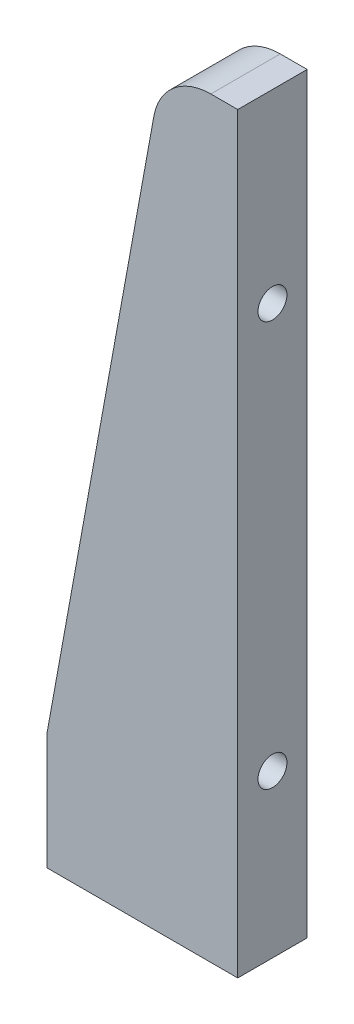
ISO-10303-21;
HEADER;
FILE_DESCRIPTION(('STEP AP214'),'2;1');
FILE_NAME('part.step','',(''),(''),'','','');
FILE_SCHEMA(('AUTOMOTIVE_DESIGN { 1 0 10303 214 1 1 1 1 }'));
ENDSEC;
DATA;
#1=APPLICATION_CONTEXT('core data for automotive mechanical design processes');
#2=APPLICATION_PROTOCOL_DEFINITION('international standard','automotive_design',2000,#1);
#3=PRODUCT_CONTEXT('',#1,'mechanical');
#4=PRODUCT('Part','Part','',(#3));
#5=PRODUCT_RELATED_PRODUCT_CATEGORY('part','',(#4));
#6=PRODUCT_DEFINITION_FORMATION('','',#4);
#7=PRODUCT_DEFINITION_CONTEXT('part definition',#1,'design');
#8=PRODUCT_DEFINITION('design','',#6,#7);
#9=PRODUCT_DEFINITION_SHAPE('','',#8);
#10=(LENGTH_UNIT() NAMED_UNIT(*) SI_UNIT(.MILLI.,.METRE.));
#11=(NAMED_UNIT(*) PLANE_ANGLE_UNIT() SI_UNIT($,.RADIAN.));
#12=(NAMED_UNIT(*) SI_UNIT($,.STERADIAN.) SOLID_ANGLE_UNIT());
#13=UNCERTAINTY_MEASURE_WITH_UNIT(LENGTH_MEASURE(1.E-05),#10,'distance_accuracy_value','');
#14=(GEOMETRIC_REPRESENTATION_CONTEXT(3) GLOBAL_UNCERTAINTY_ASSIGNED_CONTEXT((#13)) GLOBAL_UNIT_ASSIGNED_CONTEXT((#10,
#11,#12)) REPRESENTATION_CONTEXT('',''));
#15=CARTESIAN_POINT('',(0.,0.,0.));
#16=DIRECTION('',(0.,0.,1.));
#17=DIRECTION('',(1.,0.,0.));
#18=AXIS2_PLACEMENT_3D('',#15,#16,#17);
#19=CARTESIAN_POINT('',(-56.,0.,12.));
#20=DIRECTION('',(-1.,0.,0.));
#21=DIRECTION('',(0.,0.,1.));
#22=AXIS2_PLACEMENT_3D('',#19,#20,#21);
#23=PLANE('',#22);
#24=CARTESIAN_POINT('',(-56.,28.,6.));
#25=DIRECTION('',(1.,0.,0.));
#26=DIRECTION('',(0.,0.,-1.));
#27=AXIS2_PLACEMENT_3D('',#24,#25,#26);
#28=CIRCLE('',#27,2.5);
#29=CARTESIAN_POINT('',(-56.,28.,3.5));
#30=VERTEX_POINT('',#29);
#31=EDGE_CURVE('E88',#30,#30,#28,.T.);
#32=ORIENTED_EDGE('',*,*,#31,.F.);
#33=EDGE_LOOP('',(#32));
#34=FACE_BOUND('',#33,.T.);
#35=DIRECTION('',(0.,1.,0.));
#36=VECTOR('',#35,1.);
#37=CARTESIAN_POINT('',(-56.,0.,0.));
#38=LINE('',#37,#36);
#39=CARTESIAN_POINT('',(-56.,0.,0.));
#40=VERTEX_POINT('',#39);
#41=CARTESIAN_POINT('',(-56.,130.,0.));
#42=VERTEX_POINT('',#41);
#43=EDGE_CURVE('E110',#40,#42,#38,.T.);
#44=ORIENTED_EDGE('',*,*,#43,.T.);
#45=DIRECTION('',(0.,0.,-1.));
#46=VECTOR('',#45,1.);
#47=CARTESIAN_POINT('',(-56.,130.,12.));
#48=LINE('',#47,#46);
#49=CARTESIAN_POINT('',(-56.,130.,12.));
#50=VERTEX_POINT('',#49);
#51=EDGE_CURVE('E141',#50,#42,#48,.T.);
#52=ORIENTED_EDGE('',*,*,#51,.F.);
#53=DIRECTION('',(0.,1.,0.));
#54=VECTOR('',#53,1.);
#55=CARTESIAN_POINT('',(-56.,0.,12.));
#56=LINE('',#55,#54);
#57=CARTESIAN_POINT('',(-56.,0.,12.));
#58=VERTEX_POINT('',#57);
#59=EDGE_CURVE('E111',#58,#50,#56,.T.);
#60=ORIENTED_EDGE('',*,*,#59,.F.);
#61=DIRECTION('',(0.,0.,-1.));
#62=VECTOR('',#61,1.);
#63=CARTESIAN_POINT('',(-56.,0.,12.));
#64=LINE('',#63,#62);
#65=EDGE_CURVE('E123',#58,#40,#64,.T.);
#66=ORIENTED_EDGE('',*,*,#65,.T.);
#67=EDGE_LOOP('',(#44,#52,#60,#66));
#68=FACE_BOUND('',#67,.T.);
#69=CARTESIAN_POINT('',(-56.,98.,6.));
#70=DIRECTION('',(1.,0.,0.));
#71=DIRECTION('',(0.,0.,-1.));
#72=AXIS2_PLACEMENT_3D('',#69,#70,#71);
#73=CIRCLE('',#72,2.5);
#74=CARTESIAN_POINT('',(-56.,98.,3.5));
#75=VERTEX_POINT('',#74);
#76=EDGE_CURVE('E87',#75,#75,#73,.T.);
#77=ORIENTED_EDGE('',*,*,#76,.F.);
#78=EDGE_LOOP('',(#77));
#79=FACE_BOUND('',#78,.T.);
#80=ADVANCED_FACE('F16',(#34,#68,#79),#23,.F.);
#81=CARTESIAN_POINT('',(-56.,130.,12.));
#82=DIRECTION('',(0.,-1.,0.));
#83=DIRECTION('',(0.,0.,-1.));
#84=AXIS2_PLACEMENT_3D('',#81,#82,#83);
#85=PLANE('',#84);
#86=DIRECTION('',(-1.,0.,0.));
#87=VECTOR('',#86,1.);
#88=CARTESIAN_POINT('',(-56.,130.,0.));
#89=LINE('',#88,#87);
#90=CARTESIAN_POINT('',(-60.6542364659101,130.,0.));
#91=VERTEX_POINT('',#90);
#92=EDGE_CURVE('E126',#42,#91,#89,.T.);
#93=ORIENTED_EDGE('',*,*,#92,.T.);
#94=DIRECTION('',(0.,0.,-1.));
#95=VECTOR('',#94,1.);
#96=CARTESIAN_POINT('',(-60.6542364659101,130.,12.));
#97=LINE('',#96,#95);
#98=CARTESIAN_POINT('',(-60.6542364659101,130.,12.));
#99=VERTEX_POINT('',#98);
#100=EDGE_CURVE('E24',#91,#99,#97,.F.);
#101=ORIENTED_EDGE('',*,*,#100,.T.);
#102=DIRECTION('',(-1.,0.,0.));
#103=VECTOR('',#102,1.);
#104=CARTESIAN_POINT('',(-56.,130.,12.));
#105=LINE('',#104,#103);
#106=EDGE_CURVE('E114',#50,#99,#105,.T.);
#107=ORIENTED_EDGE('',*,*,#106,.F.);
#108=ORIENTED_EDGE('',*,*,#51,.T.);
#109=EDGE_LOOP('',(#93,#101,#107,#108));
#110=FACE_BOUND('',#109,.T.);
#111=ADVANCED_FACE('F178',(#110),#85,.F.);
#112=CARTESIAN_POINT('',(-69.,130.,12.));
#113=DIRECTION('',(0.983869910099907,-0.178885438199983,0.));
#114=DIRECTION('',(0.178885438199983,0.983869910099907,0.));
#115=AXIS2_PLACEMENT_3D('',#112,#113,#114);
#116=PLANE('',#115);
#117=DIRECTION('',(-0.178885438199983,-0.983869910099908,0.));
#118=VECTOR('',#117,1.);
#119=CARTESIAN_POINT('',(-69.,130.,12.));
#120=LINE('',#119,#118);
#121=CARTESIAN_POINT('',(-70.4929355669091,121.788854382,12.));
#122=VERTEX_POINT('',#121);
#123=CARTESIAN_POINT('',(-89.,20.,12.));
#124=VERTEX_POINT('',#123);
#125=EDGE_CURVE('E117',#122,#124,#120,.T.);
#126=ORIENTED_EDGE('',*,*,#125,.F.);
#127=DIRECTION('',(0.,0.,-1.));
#128=VECTOR('',#127,1.);
#129=CARTESIAN_POINT('',(-70.4929355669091,121.788854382,12.));
#130=LINE('',#129,#128);
#131=CARTESIAN_POINT('',(-70.4929355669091,121.788854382,0.));
#132=VERTEX_POINT('',#131);
#133=EDGE_CURVE('E144',#122,#132,#130,.T.);
#134=ORIENTED_EDGE('',*,*,#133,.T.);
#135=DIRECTION('',(-0.178885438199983,-0.983869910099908,0.));
#136=VECTOR('',#135,1.);
#137=CARTESIAN_POINT('',(-69.,130.,0.));
#138=LINE('',#137,#136);
#139=CARTESIAN_POINT('',(-89.,20.,0.));
#140=VERTEX_POINT('',#139);
#141=EDGE_CURVE('E128',#132,#140,#138,.T.);
#142=ORIENTED_EDGE('',*,*,#141,.T.);
#143=DIRECTION('',(0.,0.,-1.));
#144=VECTOR('',#143,1.);
#145=CARTESIAN_POINT('',(-89.,20.,12.));
#146=LINE('',#145,#144);
#147=EDGE_CURVE('E138',#124,#140,#146,.T.);
#148=ORIENTED_EDGE('',*,*,#147,.F.);
#149=EDGE_LOOP('',(#126,#134,#142,#148));
#150=FACE_BOUND('',#149,.T.);
#151=ADVANCED_FACE('F150',(#150),#116,.F.);
#152=CARTESIAN_POINT('',(-89.,0.,12.));
#153=DIRECTION('',(1.,0.,0.));
#154=DIRECTION('',(0.,0.,-1.));
#155=AXIS2_PLACEMENT_3D('',#152,#153,#154);
#156=PLANE('',#155);
#157=DIRECTION('',(0.,-1.,0.));
#158=VECTOR('',#157,1.);
#159=CARTESIAN_POINT('',(-89.,0.,0.));
#160=LINE('',#159,#158);
#161=CARTESIAN_POINT('',(-89.,0.,0.));
#162=VERTEX_POINT('',#161);
#163=EDGE_CURVE('E130',#140,#162,#160,.T.);
#164=ORIENTED_EDGE('',*,*,#163,.T.);
#165=DIRECTION('',(0.,0.,-1.));
#166=VECTOR('',#165,1.);
#167=CARTESIAN_POINT('',(-89.,0.,12.));
#168=LINE('',#167,#166);
#169=CARTESIAN_POINT('',(-89.,0.,12.));
#170=VERTEX_POINT('',#169);
#171=EDGE_CURVE('E135',#170,#162,#168,.T.);
#172=ORIENTED_EDGE('',*,*,#171,.F.);
#173=DIRECTION('',(0.,-1.,0.));
#174=VECTOR('',#173,1.);
#175=CARTESIAN_POINT('',(-89.,0.,12.));
#176=LINE('',#175,#174);
#177=EDGE_CURVE('E119',#124,#170,#176,.T.);
#178=ORIENTED_EDGE('',*,*,#177,.F.);
#179=ORIENTED_EDGE('',*,*,#147,.T.);
#180=EDGE_LOOP('',(#164,#172,#178,#179));
#181=FACE_BOUND('',#180,.T.);
#182=ADVANCED_FACE('F160',(#181),#156,.F.);
#183=CARTESIAN_POINT('',(-56.,0.,12.));
#184=DIRECTION('',(0.,1.,0.));
#185=DIRECTION('',(-1.,0.,0.));
#186=AXIS2_PLACEMENT_3D('',#183,#184,#185);
#187=PLANE('',#186);
#188=CARTESIAN_POINT('',(-80.9093619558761,0.,6.));
#189=DIRECTION('',(0.,-1.,0.));
#190=DIRECTION('',(0.,0.,-1.));
#191=AXIS2_PLACEMENT_3D('',#188,#189,#190);
#192=CIRCLE('',#191,2.5);
#193=CARTESIAN_POINT('',(-80.9093619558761,0.,3.5));
#194=VERTEX_POINT('',#193);
#195=EDGE_CURVE('E98',#194,#194,#192,.T.);
#196=ORIENTED_EDGE('',*,*,#195,.F.);
#197=EDGE_LOOP('',(#196));
#198=FACE_BOUND('',#197,.T.);
#199=CARTESIAN_POINT('',(-65.9093619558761,0.,6.));
#200=DIRECTION('',(0.,-1.,0.));
#201=DIRECTION('',(0.,0.,-1.));
#202=AXIS2_PLACEMENT_3D('',#199,#200,#201);
#203=CIRCLE('',#202,2.5);
#204=CARTESIAN_POINT('',(-65.9093619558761,0.,3.5));
#205=VERTEX_POINT('',#204);
#206=EDGE_CURVE('E104',#205,#205,#203,.T.);
#207=ORIENTED_EDGE('',*,*,#206,.F.);
#208=EDGE_LOOP('',(#207));
#209=FACE_BOUND('',#208,.T.);
#210=DIRECTION('',(1.,0.,0.));
#211=VECTOR('',#210,1.);
#212=CARTESIAN_POINT('',(-56.,0.,0.));
#213=LINE('',#212,#211);
#214=EDGE_CURVE('E115',#162,#40,#213,.T.);
#215=ORIENTED_EDGE('',*,*,#214,.T.);
#216=ORIENTED_EDGE('',*,*,#65,.F.);
#217=DIRECTION('',(1.,0.,0.));
#218=VECTOR('',#217,1.);
#219=CARTESIAN_POINT('',(-56.,0.,12.));
#220=LINE('',#219,#218);
#221=EDGE_CURVE('E121',#170,#58,#220,.T.);
#222=ORIENTED_EDGE('',*,*,#221,.F.);
#223=ORIENTED_EDGE('',*,*,#171,.T.);
#224=EDGE_LOOP('',(#215,#216,#222,#223));
#225=FACE_BOUND('',#224,.T.);
#226=ADVANCED_FACE('F164',(#198,#209,#225),#187,.F.);
#227=CARTESIAN_POINT('',(0.,0.,12.));
#228=DIRECTION('',(0.,0.,1.));
#229=DIRECTION('',(1.,0.,0.));
#230=AXIS2_PLACEMENT_3D('',#227,#228,#229);
#231=PLANE('',#230);
#232=ORIENTED_EDGE('',*,*,#106,.T.);
#233=CARTESIAN_POINT('',(-60.6542364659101,120.,12.));
#234=DIRECTION('',(0.,0.,1.));
#235=DIRECTION('',(1.,0.,0.));
#236=AXIS2_PLACEMENT_3D('',#233,#234,#235);
#237=CIRCLE('',#236,10.);
#238=EDGE_CURVE('E11',#99,#122,#237,.T.);
#239=ORIENTED_EDGE('',*,*,#238,.T.);
#240=ORIENTED_EDGE('',*,*,#125,.T.);
#241=ORIENTED_EDGE('',*,*,#177,.T.);
#242=ORIENTED_EDGE('',*,*,#221,.T.);
#243=ORIENTED_EDGE('',*,*,#59,.T.);
#244=EDGE_LOOP('',(#232,#239,#240,#241,#242,#243));
#245=FACE_BOUND('',#244,.T.);
#246=ADVANCED_FACE('F168',(#245),#231,.T.);
#247=CARTESIAN_POINT('',(0.,0.,0.));
#248=DIRECTION('',(0.,0.,1.));
#249=DIRECTION('',(1.,0.,0.));
#250=AXIS2_PLACEMENT_3D('',#247,#248,#249);
#251=PLANE('',#250);
#252=ORIENTED_EDGE('',*,*,#141,.F.);
#253=CARTESIAN_POINT('',(-60.6542364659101,120.,0.));
#254=DIRECTION('',(0.,0.,1.));
#255=DIRECTION('',(1.,0.,0.));
#256=AXIS2_PLACEMENT_3D('',#253,#254,#255);
#257=CIRCLE('',#256,10.);
#258=EDGE_CURVE('E38',#132,#91,#257,.F.);
#259=ORIENTED_EDGE('',*,*,#258,.T.);
#260=ORIENTED_EDGE('',*,*,#92,.F.);
#261=ORIENTED_EDGE('',*,*,#43,.F.);
#262=ORIENTED_EDGE('',*,*,#214,.F.);
#263=ORIENTED_EDGE('',*,*,#163,.F.);
#264=EDGE_LOOP('',(#252,#259,#260,#261,#262,#263));
#265=FACE_BOUND('',#264,.T.);
#266=ADVANCED_FACE('F155',(#265),#251,.F.);
#267=CARTESIAN_POINT('',(-65.9093619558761,17.,6.));
#268=DIRECTION('',(0.,-1.,0.));
#269=DIRECTION('',(0.,0.,-1.));
#270=AXIS2_PLACEMENT_3D('',#267,#268,#269);
#271=CONICAL_SURFACE('',#270,2.5,1.02974425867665);
#272=CARTESIAN_POINT('',(-65.9093619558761,18.5021515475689,6.));
#273=VERTEX_POINT('',#272);
#274=VERTEX_LOOP('',#273);
#275=FACE_BOUND('',#274,.T.);
#276=CARTESIAN_POINT('',(-65.9093619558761,17.,6.));
#277=DIRECTION('',(0.,-1.,0.));
#278=DIRECTION('',(0.,0.,-1.));
#279=AXIS2_PLACEMENT_3D('',#276,#277,#278);
#280=CIRCLE('',#279,2.5);
#281=CARTESIAN_POINT('',(-65.9093619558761,17.,3.5));
#282=VERTEX_POINT('',#281);
#283=EDGE_CURVE('E107',#282,#282,#280,.T.);
#284=ORIENTED_EDGE('',*,*,#283,.T.);
#285=EDGE_LOOP('',(#284));
#286=FACE_BOUND('',#285,.T.);
#287=ADVANCED_FACE('F197',(#275,#286),#271,.F.);
#288=CARTESIAN_POINT('',(-65.9093619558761,0.,6.));
#289=DIRECTION('',(0.,-1.,0.));
#290=DIRECTION('',(0.,0.,-1.));
#291=AXIS2_PLACEMENT_3D('',#288,#289,#290);
#292=CYLINDRICAL_SURFACE('',#291,2.5);
#293=ORIENTED_EDGE('',*,*,#283,.F.);
#294=EDGE_LOOP('',(#293));
#295=FACE_BOUND('',#294,.T.);
#296=ORIENTED_EDGE('',*,*,#206,.T.);
#297=EDGE_LOOP('',(#296));
#298=FACE_BOUND('',#297,.T.);
#299=ADVANCED_FACE('F202',(#295,#298),#292,.F.);
#300=CARTESIAN_POINT('',(-80.9093619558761,17.,6.));
#301=DIRECTION('',(0.,-1.,0.));
#302=DIRECTION('',(0.,0.,-1.));
#303=AXIS2_PLACEMENT_3D('',#300,#301,#302);
#304=CONICAL_SURFACE('',#303,2.5,1.02974425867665);
#305=CARTESIAN_POINT('',(-80.9093619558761,18.5021515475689,6.));
#306=VERTEX_POINT('',#305);
#307=VERTEX_LOOP('',#306);
#308=FACE_BOUND('',#307,.T.);
#309=CARTESIAN_POINT('',(-80.9093619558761,17.,6.));
#310=DIRECTION('',(0.,-1.,0.));
#311=DIRECTION('',(0.,0.,-1.));
#312=AXIS2_PLACEMENT_3D('',#309,#310,#311);
#313=CIRCLE('',#312,2.5);
#314=CARTESIAN_POINT('',(-80.9093619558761,17.,3.5));
#315=VERTEX_POINT('',#314);
#316=EDGE_CURVE('E101',#315,#315,#313,.T.);
#317=ORIENTED_EDGE('',*,*,#316,.T.);
#318=EDGE_LOOP('',(#317));
#319=FACE_BOUND('',#318,.T.);
#320=ADVANCED_FACE('F206',(#308,#319),#304,.F.);
#321=CARTESIAN_POINT('',(-80.9093619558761,0.,6.));
#322=DIRECTION('',(0.,-1.,0.));
#323=DIRECTION('',(0.,0.,-1.));
#324=AXIS2_PLACEMENT_3D('',#321,#322,#323);
#325=CYLINDRICAL_SURFACE('',#324,2.5);
#326=ORIENTED_EDGE('',*,*,#316,.F.);
#327=EDGE_LOOP('',(#326));
#328=FACE_BOUND('',#327,.T.);
#329=ORIENTED_EDGE('',*,*,#195,.T.);
#330=EDGE_LOOP('',(#329));
#331=FACE_BOUND('',#330,.T.);
#332=ADVANCED_FACE('F210',(#328,#331),#325,.F.);
#333=CARTESIAN_POINT('',(-73.,98.,6.));
#334=DIRECTION('',(1.,0.,0.));
#335=DIRECTION('',(0.,0.,-1.));
#336=AXIS2_PLACEMENT_3D('',#333,#334,#335);
#337=CONICAL_SURFACE('',#336,2.5,1.02974425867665);
#338=CARTESIAN_POINT('',(-74.5021515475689,98.,6.));
#339=VERTEX_POINT('',#338);
#340=VERTEX_LOOP('',#339);
#341=FACE_BOUND('',#340,.T.);
#342=CARTESIAN_POINT('',(-73.,98.,6.));
#343=DIRECTION('',(1.,0.,0.));
#344=DIRECTION('',(0.,0.,-1.));
#345=AXIS2_PLACEMENT_3D('',#342,#343,#344);
#346=CIRCLE('',#345,2.5);
#347=CARTESIAN_POINT('',(-73.,98.,3.5));
#348=VERTEX_POINT('',#347);
#349=EDGE_CURVE('E91',#348,#348,#346,.T.);
#350=ORIENTED_EDGE('',*,*,#349,.T.);
#351=EDGE_LOOP('',(#350));
#352=FACE_BOUND('',#351,.T.);
#353=ADVANCED_FACE('F214',(#341,#352),#337,.F.);
#354=CARTESIAN_POINT('',(-56.,98.,6.));
#355=DIRECTION('',(1.,0.,0.));
#356=DIRECTION('',(0.,0.,-1.));
#357=AXIS2_PLACEMENT_3D('',#354,#355,#356);
#358=CYLINDRICAL_SURFACE('',#357,2.5);
#359=ORIENTED_EDGE('',*,*,#349,.F.);
#360=EDGE_LOOP('',(#359));
#361=FACE_BOUND('',#360,.T.);
#362=ORIENTED_EDGE('',*,*,#76,.T.);
#363=EDGE_LOOP('',(#362));
#364=FACE_BOUND('',#363,.T.);
#365=ADVANCED_FACE('F81',(#361,#364),#358,.F.);
#366=CARTESIAN_POINT('',(-73.,28.,6.));
#367=DIRECTION('',(1.,0.,0.));
#368=DIRECTION('',(0.,0.,-1.));
#369=AXIS2_PLACEMENT_3D('',#366,#367,#368);
#370=CONICAL_SURFACE('',#369,2.5,1.02974425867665);
#371=CARTESIAN_POINT('',(-74.5021515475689,28.,6.));
#372=VERTEX_POINT('',#371);
#373=VERTEX_LOOP('',#372);
#374=FACE_BOUND('',#373,.T.);
#375=CARTESIAN_POINT('',(-73.,28.,6.));
#376=DIRECTION('',(1.,0.,0.));
#377=DIRECTION('',(0.,0.,-1.));
#378=AXIS2_PLACEMENT_3D('',#375,#376,#377);
#379=CIRCLE('',#378,2.5);
#380=CARTESIAN_POINT('',(-73.,28.,3.5));
#381=VERTEX_POINT('',#380);
#382=EDGE_CURVE('E85',#381,#381,#379,.T.);
#383=ORIENTED_EDGE('',*,*,#382,.T.);
#384=EDGE_LOOP('',(#383));
#385=FACE_BOUND('',#384,.T.);
#386=ADVANCED_FACE('F77',(#374,#385),#370,.F.);
#387=CARTESIAN_POINT('',(-56.,28.,6.));
#388=DIRECTION('',(1.,0.,0.));
#389=DIRECTION('',(0.,0.,-1.));
#390=AXIS2_PLACEMENT_3D('',#387,#388,#389);
#391=CYLINDRICAL_SURFACE('',#390,2.5);
#392=ORIENTED_EDGE('',*,*,#382,.F.);
#393=EDGE_LOOP('',(#392));
#394=FACE_BOUND('',#393,.T.);
#395=ORIENTED_EDGE('',*,*,#31,.T.);
#396=EDGE_LOOP('',(#395));
#397=FACE_BOUND('',#396,.T.);
#398=ADVANCED_FACE('F80',(#394,#397),#391,.F.);
#399=CARTESIAN_POINT('',(-60.6542364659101,120.,12.));
#400=DIRECTION('',(0.,0.,-1.));
#401=DIRECTION('',(-1.,0.,0.));
#402=AXIS2_PLACEMENT_3D('',#399,#400,#401);
#403=CYLINDRICAL_SURFACE('',#402,10.);
#404=ORIENTED_EDGE('',*,*,#238,.F.);
#405=ORIENTED_EDGE('',*,*,#100,.F.);
#406=ORIENTED_EDGE('',*,*,#258,.F.);
#407=ORIENTED_EDGE('',*,*,#133,.F.);
#408=EDGE_LOOP('',(#404,#405,#406,#407));
#409=FACE_BOUND('',#408,.T.);
#410=ADVANCED_FACE('F18',(#409),#403,.T.);
#411=CLOSED_SHELL('',(#80,#111,#151,#182,#226,#246,#266,#287,#299,#320,#332,#353,#365,#386,#398,#410));
#412=MANIFOLD_SOLID_BREP('B1',#411);
#413=ADVANCED_BREP_SHAPE_REPRESENTATION('',(#18,#412),#14);
#414=SHAPE_DEFINITION_REPRESENTATION(#9,#413);
ENDSEC;
END-ISO-10303-21;
